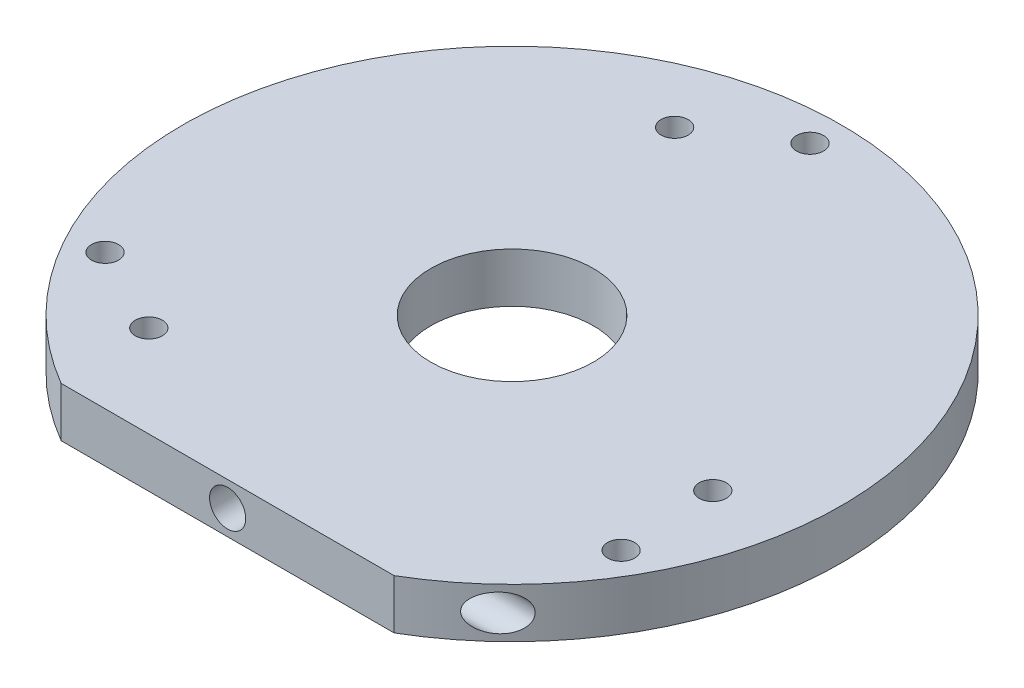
ISO-10303-21;
HEADER;
FILE_DESCRIPTION(('STEP AP214'),'2;1');
FILE_NAME('part.step','',(''),(''),'','','');
FILE_SCHEMA(('AUTOMOTIVE_DESIGN { 1 0 10303 214 1 1 1 1 }'));
ENDSEC;
DATA;
#1=APPLICATION_CONTEXT('core data for automotive mechanical design processes');
#2=APPLICATION_PROTOCOL_DEFINITION('international standard','automotive_design',2000,#1);
#3=PRODUCT_CONTEXT('',#1,'mechanical');
#4=PRODUCT('Part','Part','',(#3));
#5=PRODUCT_RELATED_PRODUCT_CATEGORY('part','',(#4));
#6=PRODUCT_DEFINITION_FORMATION('','',#4);
#7=PRODUCT_DEFINITION_CONTEXT('part definition',#1,'design');
#8=PRODUCT_DEFINITION('design','',#6,#7);
#9=PRODUCT_DEFINITION_SHAPE('','',#8);
#10=(LENGTH_UNIT() NAMED_UNIT(*) SI_UNIT(.MILLI.,.METRE.));
#11=(NAMED_UNIT(*) PLANE_ANGLE_UNIT() SI_UNIT($,.RADIAN.));
#12=(NAMED_UNIT(*) SI_UNIT($,.STERADIAN.) SOLID_ANGLE_UNIT());
#13=UNCERTAINTY_MEASURE_WITH_UNIT(LENGTH_MEASURE(1.E-05),#10,'distance_accuracy_value','');
#14=(GEOMETRIC_REPRESENTATION_CONTEXT(3) GLOBAL_UNCERTAINTY_ASSIGNED_CONTEXT((#13)) GLOBAL_UNIT_ASSIGNED_CONTEXT((#10,
#11,#12)) REPRESENTATION_CONTEXT('',''));
#15=CARTESIAN_POINT('',(0.,0.,0.));
#16=DIRECTION('',(0.,0.,1.));
#17=DIRECTION('',(1.,0.,0.));
#18=AXIS2_PLACEMENT_3D('',#15,#16,#17);
#19=CARTESIAN_POINT('',(36.501,-4.74999999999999,26.5));
#20=DIRECTION('',(-1.,0.,0.));
#21=DIRECTION('',(0.,0.,1.));
#22=AXIS2_PLACEMENT_3D('',#19,#20,#21);
#23=CYLINDRICAL_SURFACE('',#22,2.);
#24=CARTESIAN_POINT('',(22.8035085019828,-4.74999999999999,28.5));
#25=CARTESIAN_POINT('',(22.8035194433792,-4.66614474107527,28.4999917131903));
#26=CARTESIAN_POINT('',(22.8101869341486,-4.58214146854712,28.4946603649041));
#27=CARTESIAN_POINT('',(22.836100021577,-4.41730327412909,28.4738966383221));
#28=CARTESIAN_POINT('',(22.8553814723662,-4.33647808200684,28.4584354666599));
#29=CARTESIAN_POINT('',(22.9042916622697,-4.1812608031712,28.4190848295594));
#30=CARTESIAN_POINT('',(22.9338120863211,-4.10681116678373,28.3952835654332));
#31=CARTESIAN_POINT('',(23.0010219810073,-3.96449597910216,28.3408690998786));
#32=CARTESIAN_POINT('',(23.0387126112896,-3.89663136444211,28.3102549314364));
#33=CARTESIAN_POINT('',(23.1425383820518,-3.73255945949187,28.2255110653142));
#34=CARTESIAN_POINT('',(23.2129906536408,-3.64102699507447,28.1676508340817));
#35=CARTESIAN_POINT('',(23.3634974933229,-3.47316212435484,28.0429420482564));
#36=CARTESIAN_POINT('',(23.443578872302,-3.3968738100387,27.9760683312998));
#37=CARTESIAN_POINT('',(23.5892914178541,-3.27545746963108,27.8532234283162));
#38=CARTESIAN_POINT('',(23.6536059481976,-3.22728716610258,27.798639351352));
#39=CARTESIAN_POINT('',(23.784763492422,-3.13837657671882,27.6865037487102));
#40=CARTESIAN_POINT('',(23.8516077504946,-3.09764000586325,27.6289507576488));
#41=CARTESIAN_POINT('',(24.0548205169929,-2.98595285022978,27.4526435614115));
#42=CARTESIAN_POINT('',(24.1938826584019,-2.92551392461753,27.3302296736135));
#43=CARTESIAN_POINT('',(24.4802446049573,-2.82909849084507,27.0740844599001));
#44=CARTESIAN_POINT('',(24.627655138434,-2.79415684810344,26.9400986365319));
#45=CARTESIAN_POINT('',(24.9223768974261,-2.75228770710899,26.6676836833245));
#46=CARTESIAN_POINT('',(25.0696881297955,-2.74535802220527,26.5292549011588));
#47=CARTESIAN_POINT('',(25.3613275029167,-2.76070477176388,26.2505960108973));
#48=CARTESIAN_POINT('',(25.5056535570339,-2.78300097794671,26.1103647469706));
#49=CARTESIAN_POINT('',(25.7877267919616,-2.85940936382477,25.8318062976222));
#50=CARTESIAN_POINT('',(25.9254811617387,-2.91348587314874,25.6934771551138));
#51=CARTESIAN_POINT('',(26.1515970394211,-3.03641799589,25.462956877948));
#52=CARTESIAN_POINT('',(26.2427926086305,-3.09658550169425,25.3689125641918));
#53=CARTESIAN_POINT('',(26.4167638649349,-3.23641911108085,25.1877003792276));
#54=CARTESIAN_POINT('',(26.4995516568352,-3.31605660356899,25.1005226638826));
#55=CARTESIAN_POINT('',(26.6355340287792,-3.47522142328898,24.9560782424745));
#56=CARTESIAN_POINT('',(26.6911622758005,-3.55059027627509,24.8965356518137));
#57=CARTESIAN_POINT('',(26.7931403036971,-3.71346703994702,24.7867550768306));
#58=CARTESIAN_POINT('',(26.8395013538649,-3.80095998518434,24.7365057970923));
#59=CARTESIAN_POINT('',(26.9134018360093,-3.9708233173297,24.656059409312));
#60=CARTESIAN_POINT('',(26.9428120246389,-4.05144151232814,24.6238951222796));
#61=CARTESIAN_POINT('',(26.9921293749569,-4.21882955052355,24.5698249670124));
#62=CARTESIAN_POINT('',(27.0120416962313,-4.30559602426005,24.5479135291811));
#63=CARTESIAN_POINT('',(27.0412231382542,-4.48350719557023,24.5157651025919));
#64=CARTESIAN_POINT('',(27.0504384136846,-4.57467165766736,24.5055871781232));
#65=CARTESIAN_POINT('',(27.057386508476,-4.75796714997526,24.4979155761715));
#66=CARTESIAN_POINT('',(27.055122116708,-4.85009793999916,24.5004188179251));
#67=CARTESIAN_POINT('',(27.0399634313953,-5.02443145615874,24.5171466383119));
#68=CARTESIAN_POINT('',(27.0279828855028,-5.10681559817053,24.5303636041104));
#69=CARTESIAN_POINT('',(26.9952458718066,-5.26761622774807,24.5663853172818));
#70=CARTESIAN_POINT('',(26.9744886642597,-5.34603238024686,24.5891908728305));
#71=CARTESIAN_POINT('',(26.9241028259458,-5.50074948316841,24.6443529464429));
#72=CARTESIAN_POINT('',(26.8941150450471,-5.57679386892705,24.6770951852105));
#73=CARTESIAN_POINT('',(26.8269802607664,-5.72176054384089,24.7500625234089));
#74=CARTESIAN_POINT('',(26.7898292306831,-5.79067879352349,24.7902918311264));
#75=CARTESIAN_POINT('',(26.6904944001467,-5.95192247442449,24.8972894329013));
#76=CARTESIAN_POINT('',(26.6248128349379,-6.03977326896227,24.9675749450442));
#77=CARTESIAN_POINT('',(26.483957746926,-6.1988282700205,25.116938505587));
#78=CARTESIAN_POINT('',(26.4087637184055,-6.26999553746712,25.1960355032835));
#79=CARTESIAN_POINT('',(26.2230230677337,-6.41932603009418,25.3895022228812));
#80=CARTESIAN_POINT('',(26.1095309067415,-6.49069954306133,25.5062773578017));
#81=CARTESIAN_POINT('',(25.8744931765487,-6.60664263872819,25.7446859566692));
#82=CARTESIAN_POINT('',(25.7529376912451,-6.65117851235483,25.8663253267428));
#83=CARTESIAN_POINT('',(25.4683772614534,-6.72538219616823,26.1469362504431));
#84=CARTESIAN_POINT('',(25.3036716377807,-6.74685849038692,26.3063937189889));
#85=CARTESIAN_POINT('',(25.054260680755,-6.75109382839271,26.5433116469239));
#86=CARTESIAN_POINT('',(24.9706118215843,-6.74781793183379,26.6220157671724));
#87=CARTESIAN_POINT('',(24.8030436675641,-6.73210996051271,26.7782016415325));
#88=CARTESIAN_POINT('',(24.7191245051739,-6.71968184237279,26.8556839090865));
#89=CARTESIAN_POINT('',(24.5506433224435,-6.68556392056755,27.0097965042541));
#90=CARTESIAN_POINT('',(24.4660845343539,-6.66377263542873,27.0864077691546));
#91=CARTESIAN_POINT('',(24.2978650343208,-6.61081415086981,27.2374104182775));
#92=CARTESIAN_POINT('',(24.2142045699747,-6.57964443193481,27.3118012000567));
#93=CARTESIAN_POINT('',(24.0487721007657,-6.50773501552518,27.4575796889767));
#94=CARTESIAN_POINT('',(23.9669959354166,-6.46701918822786,27.5289743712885));
#95=CARTESIAN_POINT('',(23.8061573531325,-6.37551184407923,27.6681797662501));
#96=CARTESIAN_POINT('',(23.7270928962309,-6.32472810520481,27.7359931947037));
#97=CARTESIAN_POINT('',(23.5660096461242,-6.20728499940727,27.8730216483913));
#98=CARTESIAN_POINT('',(23.4843634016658,-6.13960936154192,27.9418154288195));
#99=CARTESIAN_POINT('',(23.3284027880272,-5.99021576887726,28.0721553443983));
#100=CARTESIAN_POINT('',(23.2540791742,-5.90851588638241,28.1337106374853));
#101=CARTESIAN_POINT('',(23.1324306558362,-5.7503510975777,28.2337631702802));
#102=CARTESIAN_POINT('',(23.0828195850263,-5.67696692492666,28.2743134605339));
#103=CARTESIAN_POINT('',(22.9929649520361,-5.52096081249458,28.3474321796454));
#104=CARTESIAN_POINT('',(22.9527095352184,-5.43835076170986,28.3800107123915));
#105=CARTESIAN_POINT('',(22.8923772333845,-5.28403428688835,28.4286867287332));
#106=CARTESIAN_POINT('',(22.8698066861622,-5.21395637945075,28.4468356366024));
#107=CARTESIAN_POINT('',(22.8340060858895,-5.07003923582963,28.4755808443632));
#108=CARTESIAN_POINT('',(22.8207512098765,-4.99621056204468,28.4861972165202));
#109=CARTESIAN_POINT('',(22.8096595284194,-4.89312844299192,28.4950775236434));
#110=CARTESIAN_POINT('',(22.807358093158,-4.86459020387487,28.4969195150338));
#111=CARTESIAN_POINT('',(22.8042805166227,-4.80737377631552,28.4993823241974));
#112=CARTESIAN_POINT('',(22.8035047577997,-4.77869555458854,28.5000028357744));
#113=CARTESIAN_POINT('',(22.8035085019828,-4.74999999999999,28.5));
#114=B_SPLINE_CURVE_WITH_KNOTS('',3,(#24,#25,#26,#27,#28,#29,#30,#31,#32,#33,#34,#35,#36,#37,
#38,#39,#40,#41,#42,#43,#44,#45,#46,#47,#48,#49,#50,#51,#52,#53,#54,#55,#56,#57,#58,#59,#60,#61,
#62,#63,#64,#65,#66,#67,#68,#69,#70,#71,#72,#73,#74,#75,#76,#77,#78,#79,#80,#81,#82,#83,#84,#85,
#86,#87,#88,#89,#90,#91,#92,#93,#94,#95,#96,#97,#98,#99,#100,#101,#102,#103,#104,#105,#106,#107,
#108,#109,#110,#111,#112,#113),.UNSPECIFIED.,.T.,.F.,(4,2,2,2,2,2,2,2,2,2,2,2,2,2,2,2,2,2,2,2,2,
2,2,2,2,2,2,2,2,2,2,2,2,2,2,2,2,2,2,2,2,2,2,2,4),(0.,0.251419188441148,0.503556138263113,
0.753103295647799,1.0026858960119,1.3880944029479,1.77460201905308,2.06563988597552,
2.35682280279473,2.93912672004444,3.54391885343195,4.14866377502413,4.75381802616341,
5.35829434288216,5.78938786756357,6.21985166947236,6.55165131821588,6.88304499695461,
7.15684714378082,7.43050038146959,7.7055252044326,7.98048321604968,8.23222343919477,
8.48398488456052,8.74714645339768,9.01045638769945,9.39910954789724,9.78861526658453,
10.3190888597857,10.850227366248,11.537142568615,11.881574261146,12.2258571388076,
12.573969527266,12.922175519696,13.2695199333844,13.6165970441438,13.9948499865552,
14.3726191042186,14.6639364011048,14.9548825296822,15.1814902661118,15.4074918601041,
15.4935068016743,15.5795433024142),.UNSPECIFIED.);
#115=CARTESIAN_POINT('',(22.8035085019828,-4.74999999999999,28.5));
#116=VERTEX_POINT('',#115);
#117=EDGE_CURVE('E99',#116,#116,#114,.T.);
#118=ORIENTED_EDGE('',*,*,#117,.F.);
#119=EDGE_LOOP('',(#118));
#120=FACE_BOUND('',#119,.T.);
#121=CARTESIAN_POINT('',(0.000911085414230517,-4.75,26.5));
#122=DIRECTION('',(-0.707106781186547,0.,-0.707106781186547));
#123=DIRECTION('',(-0.707106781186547,0.,0.707106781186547));
#124=AXIS2_PLACEMENT_3D('',#121,#122,#123);
#125=ELLIPSE('',#124,2.82842712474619,2.);
#126=CARTESIAN_POINT('',(0.000911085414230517,-2.75,26.5));
#127=VERTEX_POINT('',#126);
#128=CARTESIAN_POINT('',(0.000911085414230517,-6.75,26.5));
#129=VERTEX_POINT('',#128);
#130=EDGE_CURVE('E95',#127,#129,#125,.T.);
#131=ORIENTED_EDGE('',*,*,#130,.T.);
#132=CARTESIAN_POINT('',(0.000911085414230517,-4.75,26.5));
#133=DIRECTION('',(-0.707106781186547,0.,0.707106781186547));
#134=DIRECTION('',(-0.707106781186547,0.,-0.707106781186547));
#135=AXIS2_PLACEMENT_3D('',#132,#133,#134);
#136=ELLIPSE('',#135,2.82842712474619,2.);
#137=EDGE_CURVE('E94',#129,#127,#136,.T.);
#138=ORIENTED_EDGE('',*,*,#137,.T.);
#139=EDGE_LOOP('',(#131,#138));
#140=FACE_BOUND('',#139,.T.);
#141=ADVANCED_FACE('F43',(#120,#140),#23,.F.);
#142=CARTESIAN_POINT('',(0.,37.9568335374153,0.));
#143=DIRECTION('',(0.,1.,0.));
#144=DIRECTION('',(0.,0.,1.));
#145=AXIS2_PLACEMENT_3D('',#142,#143,#144);
#146=CYLINDRICAL_SURFACE('',#145,36.5);
#147=CARTESIAN_POINT('',(0.,-1.99999999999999,0.));
#148=DIRECTION('',(0.,1.,0.));
#149=DIRECTION('',(0.,0.,1.));
#150=AXIS2_PLACEMENT_3D('',#147,#148,#149);
#151=CIRCLE('',#150,36.5);
#152=CARTESIAN_POINT('',(18.4390889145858,-1.99999999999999,31.5));
#153=VERTEX_POINT('',#152);
#154=CARTESIAN_POINT('',(-18.4390889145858,-1.99999999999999,31.5));
#155=VERTEX_POINT('',#154);
#156=EDGE_CURVE('E232',#153,#155,#151,.T.);
#157=ORIENTED_EDGE('',*,*,#156,.F.);
#158=DIRECTION('',(0.,1.,0.));
#159=VECTOR('',#158,1.);
#160=CARTESIAN_POINT('',(18.4390889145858,37.9568335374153,31.5));
#161=LINE('',#160,#159);
#162=CARTESIAN_POINT('',(18.4390889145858,-7.5,31.5));
#163=VERTEX_POINT('',#162);
#164=EDGE_CURVE('E96',#153,#163,#161,.F.);
#165=ORIENTED_EDGE('',*,*,#164,.T.);
#166=CARTESIAN_POINT('',(0.,-7.5,0.));
#167=DIRECTION('',(0.,1.,0.));
#168=DIRECTION('',(0.,0.,1.));
#169=AXIS2_PLACEMENT_3D('',#166,#167,#168);
#170=CIRCLE('',#169,36.5);
#171=CARTESIAN_POINT('',(-18.4390889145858,-7.5,31.5));
#172=VERTEX_POINT('',#171);
#173=EDGE_CURVE('E236',#163,#172,#170,.T.);
#174=ORIENTED_EDGE('',*,*,#173,.T.);
#175=DIRECTION('',(0.,1.,0.));
#176=VECTOR('',#175,1.);
#177=CARTESIAN_POINT('',(-18.4390889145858,37.9568335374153,31.5));
#178=LINE('',#177,#176);
#179=EDGE_CURVE('E248',#172,#155,#178,.T.);
#180=ORIENTED_EDGE('',*,*,#179,.T.);
#181=EDGE_LOOP('',(#157,#165,#174,#180));
#182=FACE_BOUND('',#181,.T.);
#183=ORIENTED_EDGE('',*,*,#117,.T.);
#184=EDGE_LOOP('',(#183));
#185=FACE_BOUND('',#184,.T.);
#186=ADVANCED_FACE('F138',(#182,#185),#146,.T.);
#187=CARTESIAN_POINT('',(36.5,-2.,0.));
#188=DIRECTION('',(0.,-1.,0.));
#189=DIRECTION('',(0.,0.,-1.));
#190=AXIS2_PLACEMENT_3D('',#187,#188,#189);
#191=PLANE('',#190);
#192=CARTESIAN_POINT('',(-18.8964289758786,-2.,21.3348300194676));
#193=DIRECTION('',(0.,1.,0.));
#194=DIRECTION('',(0.,0.,1.));
#195=AXIS2_PLACEMENT_3D('',#192,#193,#194);
#196=CIRCLE('',#195,1.5);
#197=CARTESIAN_POINT('',(-18.8964289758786,-2.,22.8348300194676));
#198=VERTEX_POINT('',#197);
#199=EDGE_CURVE('E193',#198,#198,#196,.T.);
#200=ORIENTED_EDGE('',*,*,#199,.F.);
#201=EDGE_LOOP('',(#200));
#202=FACE_BOUND('',#201,.T.);
#203=CARTESIAN_POINT('',(-9.02829029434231,-2.,-27.0322025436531));
#204=DIRECTION('',(0.,1.,0.));
#205=DIRECTION('',(0.,0.,1.));
#206=AXIS2_PLACEMENT_3D('',#203,#204,#205);
#207=CIRCLE('',#206,1.5);
#208=CARTESIAN_POINT('',(-9.02829029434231,-2.,-25.5322025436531));
#209=VERTEX_POINT('',#208);
#210=EDGE_CURVE('E202',#209,#209,#207,.T.);
#211=ORIENTED_EDGE('',*,*,#210,.F.);
#212=EDGE_LOOP('',(#211));
#213=FACE_BOUND('',#212,.T.);
#214=CARTESIAN_POINT('',(27.924719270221,-2.,5.69737252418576));
#215=DIRECTION('',(0.,1.,0.));
#216=DIRECTION('',(0.,0.,1.));
#217=AXIS2_PLACEMENT_3D('',#214,#215,#216);
#218=CIRCLE('',#217,1.5);
#219=CARTESIAN_POINT('',(27.924719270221,-2.,7.19737252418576));
#220=VERTEX_POINT('',#219);
#221=EDGE_CURVE('E208',#220,#220,#218,.T.);
#222=ORIENTED_EDGE('',*,*,#221,.F.);
#223=EDGE_LOOP('',(#222));
#224=FACE_BOUND('',#223,.T.);
#225=CARTESIAN_POINT('',(0.,-2.,-33.));
#226=DIRECTION('',(0.,-1.,0.));
#227=DIRECTION('',(0.,0.,-1.));
#228=AXIS2_PLACEMENT_3D('',#225,#226,#227);
#229=CIRCLE('',#228,1.5);
#230=CARTESIAN_POINT('',(0.,-2.,-34.5));
#231=VERTEX_POINT('',#230);
#232=EDGE_CURVE('E216',#231,#231,#229,.T.);
#233=ORIENTED_EDGE('',*,*,#232,.T.);
#234=EDGE_LOOP('',(#233));
#235=FACE_BOUND('',#234,.T.);
#236=CARTESIAN_POINT('',(28.578838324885,-2.,16.5000000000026));
#237=DIRECTION('',(0.,-1.,0.));
#238=DIRECTION('',(0.,0.,-1.));
#239=AXIS2_PLACEMENT_3D('',#236,#237,#238);
#240=CIRCLE('',#239,1.49999999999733);
#241=CARTESIAN_POINT('',(28.578838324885,-2.,15.0000000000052));
#242=VERTEX_POINT('',#241);
#243=EDGE_CURVE('E220',#242,#242,#240,.T.);
#244=ORIENTED_EDGE('',*,*,#243,.T.);
#245=EDGE_LOOP('',(#244));
#246=FACE_BOUND('',#245,.T.);
#247=CARTESIAN_POINT('',(-28.5788383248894,-2.,16.4999999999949));
#248=DIRECTION('',(0.,-1.,0.));
#249=DIRECTION('',(0.,0.,-1.));
#250=AXIS2_PLACEMENT_3D('',#247,#248,#249);
#251=CIRCLE('',#250,1.49999999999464);
#252=CARTESIAN_POINT('',(-28.5788383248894,-2.,15.0000000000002));
#253=VERTEX_POINT('',#252);
#254=EDGE_CURVE('E224',#253,#253,#251,.T.);
#255=ORIENTED_EDGE('',*,*,#254,.T.);
#256=EDGE_LOOP('',(#255));
#257=FACE_BOUND('',#256,.T.);
#258=CARTESIAN_POINT('',(0.,-1.99999999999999,0.));
#259=DIRECTION('',(0.,1.,0.));
#260=DIRECTION('',(0.,0.,1.));
#261=AXIS2_PLACEMENT_3D('',#258,#259,#260);
#262=CIRCLE('',#261,9.00000000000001);
#263=CARTESIAN_POINT('',(0.,-1.99999999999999,9.00000000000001));
#264=VERTEX_POINT('',#263);
#265=EDGE_CURVE('E228',#264,#264,#262,.T.);
#266=ORIENTED_EDGE('',*,*,#265,.F.);
#267=EDGE_LOOP('',(#266));
#268=FACE_BOUND('',#267,.T.);
#269=ORIENTED_EDGE('',*,*,#156,.T.);
#270=DIRECTION('',(1.,0.,0.));
#271=VECTOR('',#270,1.);
#272=CARTESIAN_POINT('',(36.5,-2.,31.5));
#273=LINE('',#272,#271);
#274=EDGE_CURVE('E233',#155,#153,#273,.T.);
#275=ORIENTED_EDGE('',*,*,#274,.T.);
#276=EDGE_LOOP('',(#269,#275));
#277=FACE_BOUND('',#276,.T.);
#278=ADVANCED_FACE('F45',(#202,#213,#224,#235,#246,#257,#268,#277),#191,.F.);
#279=CARTESIAN_POINT('',(0.,37.9568335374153,0.));
#280=DIRECTION('',(0.,1.,0.));
#281=DIRECTION('',(0.,0.,1.));
#282=AXIS2_PLACEMENT_3D('',#279,#280,#281);
#283=CYLINDRICAL_SURFACE('',#282,9.00000000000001);
#284=CARTESIAN_POINT('',(0.,-7.5,0.));
#285=DIRECTION('',(0.,1.,0.));
#286=DIRECTION('',(0.,0.,1.));
#287=AXIS2_PLACEMENT_3D('',#284,#285,#286);
#288=CIRCLE('',#287,9.00000000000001);
#289=CARTESIAN_POINT('',(0.,-7.5,9.00000000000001));
#290=VERTEX_POINT('',#289);
#291=EDGE_CURVE('E239',#290,#290,#288,.T.);
#292=ORIENTED_EDGE('',*,*,#291,.F.);
#293=EDGE_LOOP('',(#292));
#294=FACE_BOUND('',#293,.T.);
#295=ORIENTED_EDGE('',*,*,#265,.T.);
#296=EDGE_LOOP('',(#295));
#297=FACE_BOUND('',#296,.T.);
#298=ADVANCED_FACE('F143',(#294,#297),#283,.F.);
#299=CARTESIAN_POINT('',(36.5,-7.5,0.));
#300=DIRECTION('',(0.,1.,0.));
#301=DIRECTION('',(0.,0.,1.));
#302=AXIS2_PLACEMENT_3D('',#299,#300,#301);
#303=PLANE('',#302);
#304=CARTESIAN_POINT('',(-18.8964289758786,-7.5,21.3348300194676));
#305=DIRECTION('',(0.,1.,0.));
#306=DIRECTION('',(0.,0.,1.));
#307=AXIS2_PLACEMENT_3D('',#304,#305,#306);
#308=CIRCLE('',#307,1.5);
#309=CARTESIAN_POINT('',(-18.8964289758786,-7.5,22.8348300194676));
#310=VERTEX_POINT('',#309);
#311=EDGE_CURVE('E191',#310,#310,#308,.T.);
#312=ORIENTED_EDGE('',*,*,#311,.T.);
#313=EDGE_LOOP('',(#312));
#314=FACE_BOUND('',#313,.T.);
#315=CARTESIAN_POINT('',(-9.02829029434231,-7.5,-27.0322025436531));
#316=DIRECTION('',(0.,1.,0.));
#317=DIRECTION('',(0.,0.,1.));
#318=AXIS2_PLACEMENT_3D('',#315,#316,#317);
#319=CIRCLE('',#318,1.5);
#320=CARTESIAN_POINT('',(-9.02829029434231,-7.5,-25.5322025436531));
#321=VERTEX_POINT('',#320);
#322=EDGE_CURVE('E197',#321,#321,#319,.T.);
#323=ORIENTED_EDGE('',*,*,#322,.T.);
#324=EDGE_LOOP('',(#323));
#325=FACE_BOUND('',#324,.T.);
#326=CARTESIAN_POINT('',(27.924719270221,-7.5,5.69737252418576));
#327=DIRECTION('',(0.,1.,0.));
#328=DIRECTION('',(0.,0.,1.));
#329=AXIS2_PLACEMENT_3D('',#326,#327,#328);
#330=CIRCLE('',#329,1.5);
#331=CARTESIAN_POINT('',(27.924719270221,-7.5,7.19737252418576));
#332=VERTEX_POINT('',#331);
#333=EDGE_CURVE('E205',#332,#332,#330,.T.);
#334=ORIENTED_EDGE('',*,*,#333,.T.);
#335=EDGE_LOOP('',(#334));
#336=FACE_BOUND('',#335,.T.);
#337=CARTESIAN_POINT('',(0.,-7.5,-33.));
#338=DIRECTION('',(0.,1.,0.));
#339=DIRECTION('',(0.,0.,1.));
#340=AXIS2_PLACEMENT_3D('',#337,#338,#339);
#341=CIRCLE('',#340,1.5);
#342=CARTESIAN_POINT('',(0.,-7.5,-31.5));
#343=VERTEX_POINT('',#342);
#344=EDGE_CURVE('E114',#343,#343,#341,.T.);
#345=ORIENTED_EDGE('',*,*,#344,.T.);
#346=EDGE_LOOP('',(#345));
#347=FACE_BOUND('',#346,.T.);
#348=CARTESIAN_POINT('',(28.578838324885,-7.5,16.5000000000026));
#349=DIRECTION('',(0.,1.,0.));
#350=DIRECTION('',(0.,0.,1.));
#351=AXIS2_PLACEMENT_3D('',#348,#349,#350);
#352=CIRCLE('',#351,1.49999999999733);
#353=CARTESIAN_POINT('',(28.578838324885,-7.5,17.9999999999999));
#354=VERTEX_POINT('',#353);
#355=EDGE_CURVE('E263',#354,#354,#352,.T.);
#356=ORIENTED_EDGE('',*,*,#355,.T.);
#357=EDGE_LOOP('',(#356));
#358=FACE_BOUND('',#357,.T.);
#359=CARTESIAN_POINT('',(-28.5788383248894,-7.5,16.4999999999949));
#360=DIRECTION('',(0.,1.,0.));
#361=DIRECTION('',(0.,0.,1.));
#362=AXIS2_PLACEMENT_3D('',#359,#360,#361);
#363=CIRCLE('',#362,1.49999999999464);
#364=CARTESIAN_POINT('',(-28.5788383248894,-7.5,17.9999999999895));
#365=VERTEX_POINT('',#364);
#366=EDGE_CURVE('E101',#365,#365,#363,.T.);
#367=ORIENTED_EDGE('',*,*,#366,.T.);
#368=EDGE_LOOP('',(#367));
#369=FACE_BOUND('',#368,.T.);
#370=ORIENTED_EDGE('',*,*,#173,.F.);
#371=DIRECTION('',(-1.,0.,0.));
#372=VECTOR('',#371,1.);
#373=CARTESIAN_POINT('',(36.5,-7.5,31.5));
#374=LINE('',#373,#372);
#375=EDGE_CURVE('E241',#163,#172,#374,.T.);
#376=ORIENTED_EDGE('',*,*,#375,.T.);
#377=EDGE_LOOP('',(#370,#376));
#378=FACE_BOUND('',#377,.T.);
#379=ORIENTED_EDGE('',*,*,#291,.T.);
#380=EDGE_LOOP('',(#379));
#381=FACE_BOUND('',#380,.T.);
#382=ADVANCED_FACE('F136',(#314,#325,#336,#347,#358,#369,#378,#381),#303,.F.);
#383=CARTESIAN_POINT('',(-18.4390889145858,-8.,31.5));
#384=DIRECTION('',(0.,0.,-1.));
#385=DIRECTION('',(-1.,0.,0.));
#386=AXIS2_PLACEMENT_3D('',#383,#384,#385);
#387=PLANE('',#386);
#388=CARTESIAN_POINT('',(0.000911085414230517,-4.75,31.5));
#389=DIRECTION('',(0.,0.,-1.));
#390=DIRECTION('',(-1.,0.,0.));
#391=AXIS2_PLACEMENT_3D('',#388,#389,#390);
#392=CIRCLE('',#391,2.);
#393=CARTESIAN_POINT('',(-1.99908891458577,-4.75,31.5));
#394=VERTEX_POINT('',#393);
#395=EDGE_CURVE('E106',#394,#394,#392,.T.);
#396=ORIENTED_EDGE('',*,*,#395,.T.);
#397=EDGE_LOOP('',(#396));
#398=FACE_BOUND('',#397,.T.);
#399=ORIENTED_EDGE('',*,*,#179,.F.);
#400=ORIENTED_EDGE('',*,*,#375,.F.);
#401=ORIENTED_EDGE('',*,*,#164,.F.);
#402=ORIENTED_EDGE('',*,*,#274,.F.);
#403=EDGE_LOOP('',(#399,#400,#401,#402));
#404=FACE_BOUND('',#403,.T.);
#405=ADVANCED_FACE('F132',(#398,#404),#387,.F.);
#406=CARTESIAN_POINT('',(-28.5788383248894,-7.5,16.4999999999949));
#407=DIRECTION('',(0.,1.,0.));
#408=DIRECTION('',(0.,0.,1.));
#409=AXIS2_PLACEMENT_3D('',#406,#407,#408);
#410=CYLINDRICAL_SURFACE('',#409,1.49999999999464);
#411=ORIENTED_EDGE('',*,*,#366,.F.);
#412=EDGE_LOOP('',(#411));
#413=FACE_BOUND('',#412,.T.);
#414=ORIENTED_EDGE('',*,*,#254,.F.);
#415=EDGE_LOOP('',(#414));
#416=FACE_BOUND('',#415,.T.);
#417=ADVANCED_FACE('F128',(#413,#416),#410,.F.);
#418=CARTESIAN_POINT('',(28.578838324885,-7.5,16.5000000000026));
#419=DIRECTION('',(0.,1.,0.));
#420=DIRECTION('',(0.,0.,1.));
#421=AXIS2_PLACEMENT_3D('',#418,#419,#420);
#422=CYLINDRICAL_SURFACE('',#421,1.49999999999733);
#423=ORIENTED_EDGE('',*,*,#355,.F.);
#424=EDGE_LOOP('',(#423));
#425=FACE_BOUND('',#424,.T.);
#426=ORIENTED_EDGE('',*,*,#243,.F.);
#427=EDGE_LOOP('',(#426));
#428=FACE_BOUND('',#427,.T.);
#429=ADVANCED_FACE('F124',(#425,#428),#422,.F.);
#430=CARTESIAN_POINT('',(0.,-7.5,-33.));
#431=DIRECTION('',(0.,1.,0.));
#432=DIRECTION('',(0.,0.,1.));
#433=AXIS2_PLACEMENT_3D('',#430,#431,#432);
#434=CYLINDRICAL_SURFACE('',#433,1.5);
#435=ORIENTED_EDGE('',*,*,#344,.F.);
#436=EDGE_LOOP('',(#435));
#437=FACE_BOUND('',#436,.T.);
#438=ORIENTED_EDGE('',*,*,#232,.F.);
#439=EDGE_LOOP('',(#438));
#440=FACE_BOUND('',#439,.T.);
#441=ADVANCED_FACE('F121',(#437,#440),#434,.F.);
#442=CARTESIAN_POINT('',(0.000911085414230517,-4.75,21.5));
#443=DIRECTION('',(0.,0.,1.));
#444=DIRECTION('',(1.,0.,0.));
#445=AXIS2_PLACEMENT_3D('',#442,#443,#444);
#446=CYLINDRICAL_SURFACE('',#445,2.);
#447=CARTESIAN_POINT('',(0.000911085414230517,-4.75,21.5));
#448=DIRECTION('',(0.,0.,-1.));
#449=DIRECTION('',(-1.,0.,0.));
#450=AXIS2_PLACEMENT_3D('',#447,#448,#449);
#451=CIRCLE('',#450,2.);
#452=CARTESIAN_POINT('',(-1.99908891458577,-4.75,21.5));
#453=VERTEX_POINT('',#452);
#454=EDGE_CURVE('E103',#453,#453,#451,.T.);
#455=ORIENTED_EDGE('',*,*,#454,.T.);
#456=EDGE_LOOP('',(#455));
#457=FACE_BOUND('',#456,.T.);
#458=ORIENTED_EDGE('',*,*,#395,.F.);
#459=EDGE_LOOP('',(#458));
#460=FACE_BOUND('',#459,.T.);
#461=CARTESIAN_POINT('',(0.,-4.74999999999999,26.5));
#462=DIRECTION('',(1.,0.,0.));
#463=DIRECTION('',(0.,0.,-1.));
#464=AXIS2_PLACEMENT_3D('',#461,#462,#463);
#465=CIRCLE('',#464,2.);
#466=CARTESIAN_POINT('',(0.,-6.74999979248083,26.5009110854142));
#467=VERTEX_POINT('',#466);
#468=CARTESIAN_POINT('',(0.,-6.74999979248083,26.4990889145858));
#469=VERTEX_POINT('',#468);
#470=EDGE_CURVE('E92',#467,#469,#465,.T.);
#471=ORIENTED_EDGE('',*,*,#470,.T.);
#472=CARTESIAN_POINT('',(0.000911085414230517,-4.75,26.5));
#473=DIRECTION('',(-0.707106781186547,0.,0.707106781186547));
#474=DIRECTION('',(-0.707106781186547,0.,-0.707106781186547));
#475=AXIS2_PLACEMENT_3D('',#472,#473,#474);
#476=ELLIPSE('',#475,2.82842712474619,2.);
#477=EDGE_CURVE('E47',#129,#469,#476,.F.);
#478=ORIENTED_EDGE('',*,*,#477,.F.);
#479=ORIENTED_EDGE('',*,*,#130,.F.);
#480=CARTESIAN_POINT('',(0.,-2.75000020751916,26.4990889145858));
#481=VERTEX_POINT('',#480);
#482=EDGE_CURVE('E11',#481,#127,#476,.F.);
#483=ORIENTED_EDGE('',*,*,#482,.F.);
#484=CARTESIAN_POINT('',(0.,-2.75000020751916,26.5009110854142));
#485=VERTEX_POINT('',#484);
#486=EDGE_CURVE('E67',#481,#485,#465,.T.);
#487=ORIENTED_EDGE('',*,*,#486,.T.);
#488=CARTESIAN_POINT('',(0.000911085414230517,-4.75,26.5));
#489=DIRECTION('',(-0.707106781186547,0.,-0.707106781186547));
#490=DIRECTION('',(-0.707106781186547,0.,0.707106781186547));
#491=AXIS2_PLACEMENT_3D('',#488,#489,#490);
#492=ELLIPSE('',#491,2.82842712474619,2.);
#493=EDGE_CURVE('E52',#127,#485,#492,.F.);
#494=ORIENTED_EDGE('',*,*,#493,.F.);
#495=ORIENTED_EDGE('',*,*,#137,.F.);
#496=EDGE_CURVE('E59',#467,#129,#492,.F.);
#497=ORIENTED_EDGE('',*,*,#496,.F.);
#498=EDGE_LOOP('',(#471,#478,#479,#483,#487,#494,#495,#497));
#499=FACE_BOUND('',#498,.T.);
#500=ADVANCED_FACE('F90',(#457,#460,#499),#446,.F.);
#501=CARTESIAN_POINT('',(0.000911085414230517,-4.75,21.5));
#502=DIRECTION('',(0.,0.,-1.));
#503=DIRECTION('',(-1.,0.,0.));
#504=AXIS2_PLACEMENT_3D('',#501,#502,#503);
#505=PLANE('',#504);
#506=ORIENTED_EDGE('',*,*,#454,.F.);
#507=EDGE_LOOP('',(#506));
#508=FACE_BOUND('',#507,.T.);
#509=ADVANCED_FACE('F160',(#508),#505,.F.);
#510=ORIENTED_EDGE('',*,*,#486,.F.);
#511=ORIENTED_EDGE('',*,*,#482,.T.);
#512=ORIENTED_EDGE('',*,*,#493,.T.);
#513=EDGE_LOOP('',(#510,#511,#512));
#514=FACE_BOUND('',#513,.T.);
#515=ADVANCED_FACE('F116',(#514),#23,.F.);
#516=ORIENTED_EDGE('',*,*,#496,.T.);
#517=ORIENTED_EDGE('',*,*,#477,.T.);
#518=ORIENTED_EDGE('',*,*,#470,.F.);
#519=EDGE_LOOP('',(#516,#517,#518));
#520=FACE_BOUND('',#519,.T.);
#521=ADVANCED_FACE('F98',(#520),#23,.F.);
#522=CARTESIAN_POINT('',(27.924719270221,-7.5,5.69737252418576));
#523=DIRECTION('',(0.,1.,0.));
#524=DIRECTION('',(0.,0.,1.));
#525=AXIS2_PLACEMENT_3D('',#522,#523,#524);
#526=CYLINDRICAL_SURFACE('',#525,1.5);
#527=ORIENTED_EDGE('',*,*,#333,.F.);
#528=EDGE_LOOP('',(#527));
#529=FACE_BOUND('',#528,.T.);
#530=ORIENTED_EDGE('',*,*,#221,.T.);
#531=EDGE_LOOP('',(#530));
#532=FACE_BOUND('',#531,.T.);
#533=ADVANCED_FACE('F163',(#529,#532),#526,.F.);
#534=CARTESIAN_POINT('',(-9.02829029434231,-7.5,-27.0322025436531));
#535=DIRECTION('',(0.,1.,0.));
#536=DIRECTION('',(0.,0.,1.));
#537=AXIS2_PLACEMENT_3D('',#534,#535,#536);
#538=CYLINDRICAL_SURFACE('',#537,1.5);
#539=ORIENTED_EDGE('',*,*,#322,.F.);
#540=EDGE_LOOP('',(#539));
#541=FACE_BOUND('',#540,.T.);
#542=ORIENTED_EDGE('',*,*,#210,.T.);
#543=EDGE_LOOP('',(#542));
#544=FACE_BOUND('',#543,.T.);
#545=ADVANCED_FACE('F167',(#541,#544),#538,.F.);
#546=CARTESIAN_POINT('',(-18.8964289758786,-7.5,21.3348300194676));
#547=DIRECTION('',(0.,1.,0.));
#548=DIRECTION('',(0.,0.,1.));
#549=AXIS2_PLACEMENT_3D('',#546,#547,#548);
#550=CYLINDRICAL_SURFACE('',#549,1.5);
#551=ORIENTED_EDGE('',*,*,#311,.F.);
#552=EDGE_LOOP('',(#551));
#553=FACE_BOUND('',#552,.T.);
#554=ORIENTED_EDGE('',*,*,#199,.T.);
#555=EDGE_LOOP('',(#554));
#556=FACE_BOUND('',#555,.T.);
#557=ADVANCED_FACE('F173',(#553,#556),#550,.F.);
#558=CLOSED_SHELL('',(#141,#186,#278,#298,#382,#405,#417,#429,#441,#500,#509,#515,#521,#533,
#545,#557));
#559=MANIFOLD_SOLID_BREP('B2',#558);
#560=ADVANCED_BREP_SHAPE_REPRESENTATION('',(#18,#559),#14);
#561=SHAPE_DEFINITION_REPRESENTATION(#9,#560);
ENDSEC;
END-ISO-10303-21;
